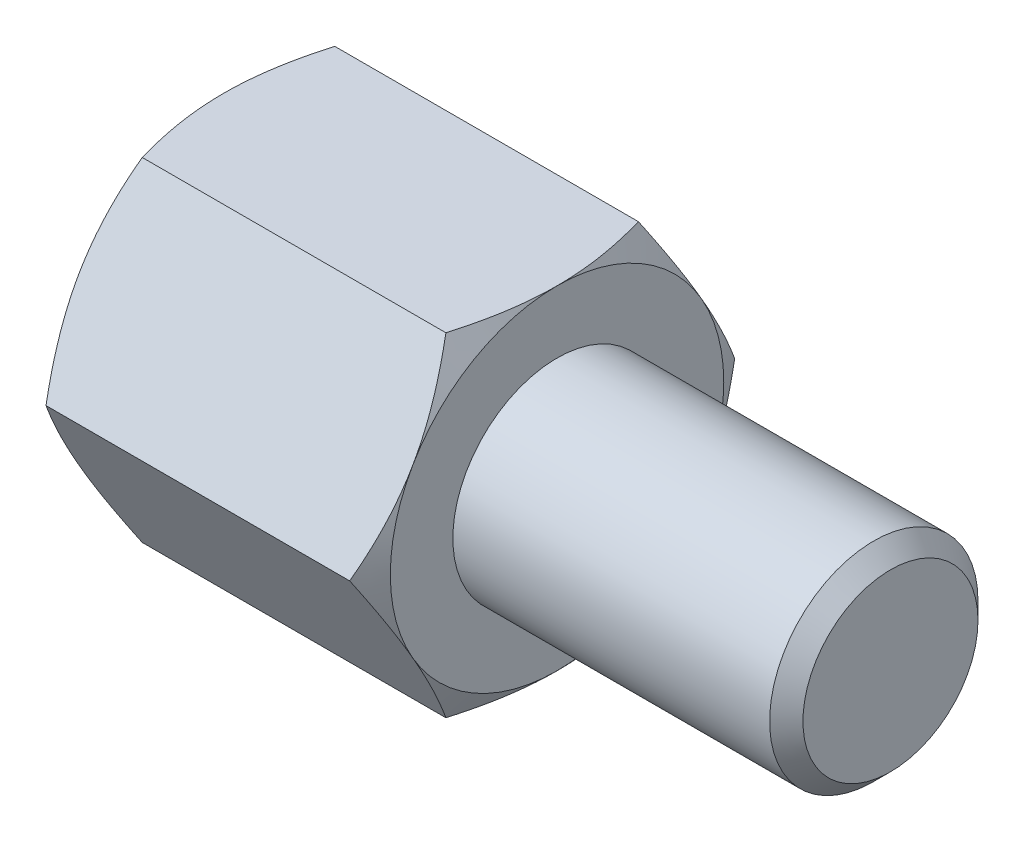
ISO-10303-21;
HEADER;
FILE_DESCRIPTION(('STEP AP214'),'2;1');
FILE_NAME('part.step','',(''),(''),'','','');
FILE_SCHEMA(('AUTOMOTIVE_DESIGN { 1 0 10303 214 1 1 1 1 }'));
ENDSEC;
DATA;
#1=APPLICATION_CONTEXT('core data for automotive mechanical design processes');
#2=APPLICATION_PROTOCOL_DEFINITION('international standard','automotive_design',2000,#1);
#3=PRODUCT_CONTEXT('',#1,'mechanical');
#4=PRODUCT('Part','Part','',(#3));
#5=PRODUCT_RELATED_PRODUCT_CATEGORY('part','',(#4));
#6=PRODUCT_DEFINITION_FORMATION('','',#4);
#7=PRODUCT_DEFINITION_CONTEXT('part definition',#1,'design');
#8=PRODUCT_DEFINITION('design','',#6,#7);
#9=PRODUCT_DEFINITION_SHAPE('','',#8);
#10=(LENGTH_UNIT() NAMED_UNIT(*) SI_UNIT(.MILLI.,.METRE.));
#11=(NAMED_UNIT(*) PLANE_ANGLE_UNIT() SI_UNIT($,.RADIAN.));
#12=(NAMED_UNIT(*) SI_UNIT($,.STERADIAN.) SOLID_ANGLE_UNIT());
#13=UNCERTAINTY_MEASURE_WITH_UNIT(LENGTH_MEASURE(1.E-05),#10,'distance_accuracy_value','');
#14=(GEOMETRIC_REPRESENTATION_CONTEXT(3) GLOBAL_UNCERTAINTY_ASSIGNED_CONTEXT((#13)) GLOBAL_UNIT_ASSIGNED_CONTEXT((#10,
#11,#12)) REPRESENTATION_CONTEXT('',''));
#15=CARTESIAN_POINT('',(0.,0.,0.));
#16=DIRECTION('',(0.,0.,1.));
#17=DIRECTION('',(1.,0.,0.));
#18=AXIS2_PLACEMENT_3D('',#15,#16,#17);
#19=CARTESIAN_POINT('',(4.,4.,-2.3094010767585));
#20=DIRECTION('',(1.,0.,0.));
#21=DIRECTION('',(0.,0.,-1.));
#22=AXIS2_PLACEMENT_3D('',#19,#20,#21);
#23=PLANE('',#22);
#24=CARTESIAN_POINT('',(4.,0.,0.));
#25=DIRECTION('',(1.,0.,0.));
#26=DIRECTION('',(0.,0.,-1.));
#27=AXIS2_PLACEMENT_3D('',#24,#25,#26);
#28=CIRCLE('',#27,4.);
#29=CARTESIAN_POINT('',(4.,-2.,-3.46410161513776));
#30=VERTEX_POINT('',#29);
#31=CARTESIAN_POINT('',(4.,2.,-3.46410161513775));
#32=VERTEX_POINT('',#31);
#33=EDGE_CURVE('E288',#30,#32,#28,.T.);
#34=ORIENTED_EDGE('',*,*,#33,.T.);
#35=CARTESIAN_POINT('',(4.,4.,0.));
#36=VERTEX_POINT('',#35);
#37=EDGE_CURVE('E53',#32,#36,#28,.T.);
#38=ORIENTED_EDGE('',*,*,#37,.T.);
#39=CARTESIAN_POINT('',(4.,2.,3.46410161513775));
#40=VERTEX_POINT('',#39);
#41=EDGE_CURVE('E296',#36,#40,#28,.T.);
#42=ORIENTED_EDGE('',*,*,#41,.T.);
#43=CARTESIAN_POINT('',(4.,-2.,3.46410161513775));
#44=VERTEX_POINT('',#43);
#45=EDGE_CURVE('E300',#40,#44,#28,.T.);
#46=ORIENTED_EDGE('',*,*,#45,.T.);
#47=CARTESIAN_POINT('',(4.,0.,0.));
#48=DIRECTION('',(-1.,0.,0.));
#49=DIRECTION('',(0.,-1.,0.));
#50=AXIS2_PLACEMENT_3D('',#47,#48,#49);
#51=CIRCLE('',#50,4.);
#52=CARTESIAN_POINT('',(4.,-4.,0.));
#53=VERTEX_POINT('',#52);
#54=EDGE_CURVE('E193',#53,#44,#51,.T.);
#55=ORIENTED_EDGE('',*,*,#54,.F.);
#56=EDGE_CURVE('E61',#53,#30,#28,.T.);
#57=ORIENTED_EDGE('',*,*,#56,.T.);
#58=EDGE_LOOP('',(#34,#38,#42,#46,#55,#57));
#59=FACE_BOUND('',#58,.T.);
#60=CARTESIAN_POINT('',(4.,0.,0.));
#61=DIRECTION('',(1.,0.,0.));
#62=DIRECTION('',(0.,0.,-1.));
#63=AXIS2_PLACEMENT_3D('',#60,#61,#62);
#64=CIRCLE('',#63,2.5);
#65=CARTESIAN_POINT('',(4.,0.,-2.5));
#66=VERTEX_POINT('',#65);
#67=EDGE_CURVE('E310',#66,#66,#64,.T.);
#68=ORIENTED_EDGE('',*,*,#67,.F.);
#69=EDGE_LOOP('',(#68));
#70=FACE_BOUND('',#69,.T.);
#71=ADVANCED_FACE('F37',(#59,#70),#23,.T.);
#72=CARTESIAN_POINT('',(4.,0.,-4.61880215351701));
#73=DIRECTION('',(0.,-0.5,0.866025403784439));
#74=DIRECTION('',(0.,-0.866025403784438,-0.5));
#75=AXIS2_PLACEMENT_3D('',#72,#73,#74);
#76=PLANE('',#75);
#77=CARTESIAN_POINT('',(3.64266774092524,-0.000200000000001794,-4.61891762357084));
#78=CARTESIAN_POINT('',(3.70128212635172,0.175579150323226,-4.5174314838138));
#79=CARTESIAN_POINT('',(3.75458967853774,0.352875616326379,-4.41506932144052));
#80=CARTESIAN_POINT('',(3.8476383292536,0.710538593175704,-4.2085725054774));
#81=CARTESIAN_POINT('',(3.8873465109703,0.890911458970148,-4.10443418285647));
#82=CARTESIAN_POINT('',(3.94915778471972,1.24942181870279,-3.89744813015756));
#83=CARTESIAN_POINT('',(3.97167226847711,1.42750415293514,-3.79463224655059));
#84=CARTESIAN_POINT('',(3.99854937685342,1.78450671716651,-3.58851671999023));
#85=CARTESIAN_POINT('',(4.00293425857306,1.9634256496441,-3.48521782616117));
#86=CARTESIAN_POINT('',(3.99380992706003,2.29774284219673,-3.29219970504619));
#87=CARTESIAN_POINT('',(3.98254104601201,2.45319115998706,-3.20245157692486));
#88=CARTESIAN_POINT('',(3.94682600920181,2.76307505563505,-3.02354002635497));
#89=CARTESIAN_POINT('',(3.92236765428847,2.91750956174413,-2.93437722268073));
#90=CARTESIAN_POINT('',(3.86122393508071,3.22803232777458,-2.75509682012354));
#91=CARTESIAN_POINT('',(3.82427939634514,3.3840812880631,-2.6650019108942));
#92=CARTESIAN_POINT('',(3.74042992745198,3.69385183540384,-2.486155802));
#93=CARTESIAN_POINT('',(3.69354469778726,3.84757739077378,-2.39740231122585));
#94=CARTESIAN_POINT('',(3.64266774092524,4.0002,-2.30928560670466));
#95=B_SPLINE_CURVE_WITH_KNOTS('',3,(#77,#78,#79,#80,#81,#82,#83,#84,#85,#86,#87,#88,#89,#90,#91,
#92,#93,#94),.UNSPECIFIED.,.F.,.F.,(4,2,2,2,2,2,2,2,4),(0.,0.634047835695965,1.26961969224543,
1.88946157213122,2.50854226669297,3.04757825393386,3.58711366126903,4.13861653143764,
4.68903648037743),.UNSPECIFIED.);
#96=CARTESIAN_POINT('',(3.64273441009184,0.,-4.61880215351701));
#97=VERTEX_POINT('',#96);
#98=EDGE_CURVE('E320',#97,#32,#95,.T.);
#99=ORIENTED_EDGE('',*,*,#98,.F.);
#100=DIRECTION('',(-1.,0.,0.));
#101=VECTOR('',#100,1.);
#102=CARTESIAN_POINT('',(4.,0.,-4.61880215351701));
#103=LINE('',#102,#101);
#104=CARTESIAN_POINT('',(-3.64273441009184,0.,-4.61880215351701));
#105=VERTEX_POINT('',#104);
#106=EDGE_CURVE('E264',#97,#105,#103,.T.);
#107=ORIENTED_EDGE('',*,*,#106,.T.);
#108=CARTESIAN_POINT('',(-3.64266774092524,4.0002,-2.30928560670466));
#109=CARTESIAN_POINT('',(-3.70128212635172,3.82442084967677,-2.4107717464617));
#110=CARTESIAN_POINT('',(-3.75458967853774,3.64712438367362,-2.51313390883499));
#111=CARTESIAN_POINT('',(-3.8476383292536,3.28946140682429,-2.71963072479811));
#112=CARTESIAN_POINT('',(-3.8873465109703,3.10908854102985,-2.82376904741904));
#113=CARTESIAN_POINT('',(-3.94915778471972,2.75057818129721,-3.03075510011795));
#114=CARTESIAN_POINT('',(-3.97167226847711,2.57249584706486,-3.13357098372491));
#115=CARTESIAN_POINT('',(-3.99854937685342,2.21549328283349,-3.33968651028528));
#116=CARTESIAN_POINT('',(-4.00293425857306,2.0365743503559,-3.44298540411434));
#117=CARTESIAN_POINT('',(-3.99380992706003,1.70225715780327,-3.63600352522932));
#118=CARTESIAN_POINT('',(-3.98254104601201,1.54680884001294,-3.72575165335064));
#119=CARTESIAN_POINT('',(-3.94682600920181,1.23692494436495,-3.90466320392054));
#120=CARTESIAN_POINT('',(-3.92236765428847,1.08249043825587,-3.99382600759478));
#121=CARTESIAN_POINT('',(-3.86122393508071,0.771967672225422,-4.17310641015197));
#122=CARTESIAN_POINT('',(-3.82427939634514,0.615918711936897,-4.26320131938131));
#123=CARTESIAN_POINT('',(-3.74042992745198,0.306148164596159,-4.4420474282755));
#124=CARTESIAN_POINT('',(-3.69354469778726,0.152422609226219,-4.53080091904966));
#125=CARTESIAN_POINT('',(-3.64266774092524,-0.000200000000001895,-4.61891762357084));
#126=B_SPLINE_CURVE_WITH_KNOTS('',3,(#108,#109,#110,#111,#112,#113,#114,#115,#116,#117,#118,
#119,#120,#121,#122,#123,#124,#125),.UNSPECIFIED.,.F.,.F.,(4,2,2,2,2,2,2,2,4),(0.,
0.634047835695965,1.26961969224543,1.88946157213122,2.50854226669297,3.04757825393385,
3.58711366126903,4.13861653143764,4.68903648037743),.UNSPECIFIED.);
#127=CARTESIAN_POINT('',(-4.,2.,-3.46410161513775));
#128=VERTEX_POINT('',#127);
#129=EDGE_CURVE('E324',#128,#105,#126,.T.);
#130=ORIENTED_EDGE('',*,*,#129,.F.);
#131=CARTESIAN_POINT('',(-3.64273441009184,4.,-2.3094010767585));
#132=VERTEX_POINT('',#131);
#133=EDGE_CURVE('E321',#132,#128,#126,.T.);
#134=ORIENTED_EDGE('',*,*,#133,.F.);
#135=DIRECTION('',(-1.,0.,0.));
#136=VECTOR('',#135,1.);
#137=CARTESIAN_POINT('',(4.,4.,-2.3094010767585));
#138=LINE('',#137,#136);
#139=CARTESIAN_POINT('',(3.64273441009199,4.,-2.30940107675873));
#140=VERTEX_POINT('',#139);
#141=EDGE_CURVE('E279',#140,#132,#138,.T.);
#142=ORIENTED_EDGE('',*,*,#141,.F.);
#143=EDGE_CURVE('E229',#32,#140,#95,.T.);
#144=ORIENTED_EDGE('',*,*,#143,.F.);
#145=EDGE_LOOP('',(#99,#107,#130,#134,#142,#144));
#146=FACE_BOUND('',#145,.T.);
#147=ADVANCED_FACE('F148',(#146),#76,.F.);
#148=CARTESIAN_POINT('',(4.,4.,-2.3094010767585));
#149=DIRECTION('',(0.,-1.,0.));
#150=DIRECTION('',(0.,0.,-1.));
#151=AXIS2_PLACEMENT_3D('',#148,#149,#150);
#152=PLANE('',#151);
#153=CARTESIAN_POINT('',(2.00829070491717,4.,-6.28479524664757));
#154=CARTESIAN_POINT('',(2.09370060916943,4.,-6.10939349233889));
#155=CARTESIAN_POINT('',(2.17831482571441,4.,-5.93359774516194));
#156=CARTESIAN_POINT('',(2.34550596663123,4.,-5.58100905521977));
#157=CARTESIAN_POINT('',(2.42808258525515,4.,-5.40421596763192));
#158=CARTESIAN_POINT('',(2.59115082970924,4.,-5.04855089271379));
#159=CARTESIAN_POINT('',(2.67162934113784,4.,-4.86967287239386));
#160=CARTESIAN_POINT('',(2.82940015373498,4.,-4.51052237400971));
#161=CARTESIAN_POINT('',(2.90669260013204,4.,-4.33024995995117));
#162=CARTESIAN_POINT('',(3.05980205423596,4.,-3.96189114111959));
#163=CARTESIAN_POINT('',(3.135480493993,4.,-3.77374683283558));
#164=CARTESIAN_POINT('',(3.28130452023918,4.,-3.39528725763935));
#165=CARTESIAN_POINT('',(3.35144949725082,4.,-3.2049717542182));
#166=CARTESIAN_POINT('',(3.4844245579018,4.,-2.82219775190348));
#167=CARTESIAN_POINT('',(3.5472687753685,4.,-2.62974421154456));
#168=CARTESIAN_POINT('',(3.66367969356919,4.,-2.24207725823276));
#169=CARTESIAN_POINT('',(3.71724923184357,4.,-2.04686470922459));
#170=CARTESIAN_POINT('',(3.81230316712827,4.,-1.65467425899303));
#171=CARTESIAN_POINT('',(3.85385633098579,4.,-1.45771333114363));
#172=CARTESIAN_POINT('',(3.92259036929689,4.,-1.06125849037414));
#173=CARTESIAN_POINT('',(3.94977273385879,4.,-0.861764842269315));
#174=CARTESIAN_POINT('',(3.98724473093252,4.,-0.463879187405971));
#175=CARTESIAN_POINT('',(3.99775780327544,4.,-0.265508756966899));
#176=CARTESIAN_POINT('',(4.00159342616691,4.,0.131417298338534));
#177=CARTESIAN_POINT('',(3.99491584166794,4.,0.329972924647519));
#178=CARTESIAN_POINT('',(3.96964892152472,4.,0.664692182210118));
#179=CARTESIAN_POINT('',(3.95537089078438,4.,0.801202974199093));
#180=CARTESIAN_POINT('',(3.9195349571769,4.,1.07327201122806));
#181=CARTESIAN_POINT('',(3.89797613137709,4.,1.20883013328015));
#182=CARTESIAN_POINT('',(3.82350663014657,4.,1.61386939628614));
#183=CARTESIAN_POINT('',(3.76081499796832,4.,1.8815748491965));
#184=CARTESIAN_POINT('',(3.65151174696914,4.,2.28197262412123));
#185=CARTESIAN_POINT('',(3.61200931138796,4.,2.41672443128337));
#186=CARTESIAN_POINT('',(3.52875235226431,4.,2.6849206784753));
#187=CARTESIAN_POINT('',(3.48499779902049,4.,2.81836510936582));
#188=CARTESIAN_POINT('',(3.3939510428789,4.,3.08398596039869));
#189=CARTESIAN_POINT('',(3.34665989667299,4.,3.21616274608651));
#190=CARTESIAN_POINT('',(3.24911111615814,4.,3.47941134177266));
#191=CARTESIAN_POINT('',(3.1988535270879,4.,3.61048316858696));
#192=CARTESIAN_POINT('',(3.07132952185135,4.,3.93385125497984));
#193=CARTESIAN_POINT('',(2.9926014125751,4.,4.1255702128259));
#194=CARTESIAN_POINT('',(2.83096938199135,4.,4.5072455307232));
#195=CARTESIAN_POINT('',(2.74806513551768,4.,4.69720175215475));
#196=CARTESIAN_POINT('',(2.5789699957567,4.,5.0756995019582));
#197=CARTESIAN_POINT('',(2.49277827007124,4.,5.264240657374));
#198=CARTESIAN_POINT('',(2.3178011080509,4.,5.64011758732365));
#199=CARTESIAN_POINT('',(2.22901560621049,4.,5.82745333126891));
#200=CARTESIAN_POINT('',(1.95934323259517,4.,6.3884442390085));
#201=CARTESIAN_POINT('',(1.77535618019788,4.,6.76060781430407));
#202=CARTESIAN_POINT('',(1.4019562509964,4.,7.50211228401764));
#203=CARTESIAN_POINT('',(1.2125442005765,4.,7.87145359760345));
#204=CARTESIAN_POINT('',(0.847387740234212,4.,8.57450173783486));
#205=CARTESIAN_POINT('',(0.671975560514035,4.,8.90838144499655));
#206=CARTESIAN_POINT('',(0.318809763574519,4.,9.57491712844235));
#207=CARTESIAN_POINT('',(0.141056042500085,4.,9.9075730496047));
#208=CARTESIAN_POINT('',(-0.215706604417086,4.,10.5709822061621));
#209=CARTESIAN_POINT('',(-0.394710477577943,3.99999999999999,10.9017381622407));
#210=CARTESIAN_POINT('',(-0.754092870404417,3.99999999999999,11.5624752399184));
#211=CARTESIAN_POINT('',(-0.934471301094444,3.99999999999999,11.8924564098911));
#212=CARTESIAN_POINT('',(-1.11535751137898,3.99999999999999,12.2221569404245));
#213=B_SPLINE_CURVE_WITH_KNOTS('',3,(#153,#154,#155,#156,#157,#158,#159,#160,#161,#162,#163,
#164,#165,#166,#167,#168,#169,#170,#171,#172,#173,#174,#175,#176,#177,#178,#179,#180,#181,#182,
#183,#184,#185,#186,#187,#188,#189,#190,#191,#192,#193,#194,#195,#196,#197,#198,#199,#200,#201,
#202,#203,#204,#205,#206,#207,#208,#209,#210,#211,#212),.UNSPECIFIED.,.F.,.F.,(4,2,2,2,2,2,2,2,
2,2,2,2,2,2,2,2,2,2,2,2,2,2,2,2,2,2,2,2,2,4),(0.,0.585280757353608,1.17064881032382,
1.75906864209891,2.34746162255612,2.95577704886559,3.56415938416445,4.17134357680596,
4.7783416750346,5.38179402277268,5.98518378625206,6.58041501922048,7.17565092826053,
7.58721910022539,7.99883946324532,8.82250155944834,9.24373134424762,9.66496407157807,
10.086071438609,10.5071723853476,11.1288656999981,11.7506074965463,12.3725077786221,
12.9944237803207,14.2398211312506,15.4850297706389,16.6164791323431,17.7479788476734,
18.8762380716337,20.0044248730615),.UNSPECIFIED.);
#214=EDGE_CURVE('E227',#140,#36,#213,.T.);
#215=ORIENTED_EDGE('',*,*,#214,.F.);
#216=ORIENTED_EDGE('',*,*,#141,.T.);
#217=CARTESIAN_POINT('',(-2.00829070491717,4.,-6.28479524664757));
#218=CARTESIAN_POINT('',(-2.09370060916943,4.,-6.10939349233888));
#219=CARTESIAN_POINT('',(-2.17831482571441,4.,-5.93359774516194));
#220=CARTESIAN_POINT('',(-2.34550596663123,4.,-5.58100905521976));
#221=CARTESIAN_POINT('',(-2.42808258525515,4.,-5.40421596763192));
#222=CARTESIAN_POINT('',(-2.59115082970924,4.,-5.04855089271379));
#223=CARTESIAN_POINT('',(-2.67162934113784,4.,-4.86967287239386));
#224=CARTESIAN_POINT('',(-2.82940015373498,4.,-4.51052237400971));
#225=CARTESIAN_POINT('',(-2.90669260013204,4.,-4.33024995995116));
#226=CARTESIAN_POINT('',(-3.05980205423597,4.,-3.96189114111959));
#227=CARTESIAN_POINT('',(-3.135480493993,4.,-3.77374683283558));
#228=CARTESIAN_POINT('',(-3.28130452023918,4.,-3.39528725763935));
#229=CARTESIAN_POINT('',(-3.35144949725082,4.,-3.2049717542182));
#230=CARTESIAN_POINT('',(-3.4844245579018,4.,-2.82219775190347));
#231=CARTESIAN_POINT('',(-3.5472687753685,4.,-2.62974421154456));
#232=CARTESIAN_POINT('',(-3.66367969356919,4.,-2.24207725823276));
#233=CARTESIAN_POINT('',(-3.71724923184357,4.,-2.04686470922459));
#234=CARTESIAN_POINT('',(-3.81230316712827,4.,-1.65467425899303));
#235=CARTESIAN_POINT('',(-3.85385633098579,4.,-1.45771333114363));
#236=CARTESIAN_POINT('',(-3.92259036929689,4.,-1.06125849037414));
#237=CARTESIAN_POINT('',(-3.94977273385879,4.,-0.861764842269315));
#238=CARTESIAN_POINT('',(-3.98724473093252,4.,-0.463879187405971));
#239=CARTESIAN_POINT('',(-3.99775780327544,4.,-0.265508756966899));
#240=CARTESIAN_POINT('',(-4.00159342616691,4.,0.131417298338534));
#241=CARTESIAN_POINT('',(-3.99491584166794,4.,0.329972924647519));
#242=CARTESIAN_POINT('',(-3.96964892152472,4.,0.664692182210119));
#243=CARTESIAN_POINT('',(-3.95537089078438,4.,0.801202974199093));
#244=CARTESIAN_POINT('',(-3.9195349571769,4.,1.07327201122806));
#245=CARTESIAN_POINT('',(-3.89797613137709,4.,1.20883013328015));
#246=CARTESIAN_POINT('',(-3.82350663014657,4.,1.61386939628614));
#247=CARTESIAN_POINT('',(-3.76081499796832,4.,1.8815748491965));
#248=CARTESIAN_POINT('',(-3.65151174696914,4.,2.28197262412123));
#249=CARTESIAN_POINT('',(-3.61200931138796,4.,2.41672443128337));
#250=CARTESIAN_POINT('',(-3.52875235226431,4.,2.68492067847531));
#251=CARTESIAN_POINT('',(-3.48499779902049,4.,2.81836510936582));
#252=CARTESIAN_POINT('',(-3.3939510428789,4.,3.08398596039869));
#253=CARTESIAN_POINT('',(-3.34665989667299,4.,3.21616274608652));
#254=CARTESIAN_POINT('',(-3.24911111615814,4.,3.47941134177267));
#255=CARTESIAN_POINT('',(-3.1988535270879,4.,3.61048316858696));
#256=CARTESIAN_POINT('',(-3.07132952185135,4.,3.93385125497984));
#257=CARTESIAN_POINT('',(-2.9926014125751,4.,4.1255702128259));
#258=CARTESIAN_POINT('',(-2.83096938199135,4.,4.5072455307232));
#259=CARTESIAN_POINT('',(-2.74806513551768,4.,4.69720175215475));
#260=CARTESIAN_POINT('',(-2.5789699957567,4.,5.0756995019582));
#261=CARTESIAN_POINT('',(-2.49277827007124,4.,5.264240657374));
#262=CARTESIAN_POINT('',(-2.3178011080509,4.,5.64011758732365));
#263=CARTESIAN_POINT('',(-2.22901560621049,4.,5.82745333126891));
#264=CARTESIAN_POINT('',(-1.95934323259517,4.,6.3884442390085));
#265=CARTESIAN_POINT('',(-1.77535618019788,4.,6.76060781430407));
#266=CARTESIAN_POINT('',(-1.4019562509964,4.,7.50211228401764));
#267=CARTESIAN_POINT('',(-1.2125442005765,4.,7.87145359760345));
#268=CARTESIAN_POINT('',(-0.847387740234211,4.,8.57450173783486));
#269=CARTESIAN_POINT('',(-0.671975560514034,4.,8.90838144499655));
#270=CARTESIAN_POINT('',(-0.318809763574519,4.,9.57491712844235));
#271=CARTESIAN_POINT('',(-0.141056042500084,4.,9.9075730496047));
#272=CARTESIAN_POINT('',(0.215706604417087,4.,10.5709822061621));
#273=CARTESIAN_POINT('',(0.394710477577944,3.99999999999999,10.9017381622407));
#274=CARTESIAN_POINT('',(0.754092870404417,3.99999999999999,11.5624752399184));
#275=CARTESIAN_POINT('',(0.934471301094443,3.99999999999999,11.8924564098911));
#276=CARTESIAN_POINT('',(1.11535751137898,3.99999999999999,12.2221569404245));
#277=B_SPLINE_CURVE_WITH_KNOTS('',3,(#217,#218,#219,#220,#221,#222,#223,#224,#225,#226,#227,
#228,#229,#230,#231,#232,#233,#234,#235,#236,#237,#238,#239,#240,#241,#242,#243,#244,#245,#246,
#247,#248,#249,#250,#251,#252,#253,#254,#255,#256,#257,#258,#259,#260,#261,#262,#263,#264,#265,
#266,#267,#268,#269,#270,#271,#272,#273,#274,#275,#276),.UNSPECIFIED.,.F.,.F.,(4,2,2,2,2,2,2,2,
2,2,2,2,2,2,2,2,2,2,2,2,2,2,2,2,2,2,2,2,2,4),(0.,0.585280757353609,1.17064881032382,
1.75906864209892,2.34746162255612,2.95577704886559,3.56415938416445,4.17134357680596,
4.7783416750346,5.38179402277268,5.98518378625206,6.58041501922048,7.17565092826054,
7.58721910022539,7.99883946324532,8.82250155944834,9.24373134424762,9.66496407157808,
10.086071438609,10.5071723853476,11.1288656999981,11.7506074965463,12.3725077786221,
12.9944237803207,14.2398211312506,15.4850297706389,16.6164791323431,17.7479788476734,
18.8762380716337,20.0044248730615),.UNSPECIFIED.);
#278=CARTESIAN_POINT('',(-4.,4.,0.));
#279=VERTEX_POINT('',#278);
#280=EDGE_CURVE('E241',#279,#132,#277,.F.);
#281=ORIENTED_EDGE('',*,*,#280,.F.);
#282=CARTESIAN_POINT('',(-3.64273441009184,4.,2.3094010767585));
#283=VERTEX_POINT('',#282);
#284=EDGE_CURVE('E249',#283,#279,#277,.F.);
#285=ORIENTED_EDGE('',*,*,#284,.F.);
#286=DIRECTION('',(-1.,0.,0.));
#287=VECTOR('',#286,1.);
#288=CARTESIAN_POINT('',(4.,4.,2.3094010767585));
#289=LINE('',#288,#287);
#290=CARTESIAN_POINT('',(3.64273441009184,4.,2.3094010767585));
#291=VERTEX_POINT('',#290);
#292=EDGE_CURVE('E276',#291,#283,#289,.T.);
#293=ORIENTED_EDGE('',*,*,#292,.F.);
#294=EDGE_CURVE('E221',#36,#291,#213,.T.);
#295=ORIENTED_EDGE('',*,*,#294,.F.);
#296=EDGE_LOOP('',(#215,#216,#281,#285,#293,#295));
#297=FACE_BOUND('',#296,.T.);
#298=ADVANCED_FACE('F153',(#297),#152,.F.);
#299=CARTESIAN_POINT('',(4.,4.,2.3094010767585));
#300=DIRECTION('',(0.,-0.5,-0.866025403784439));
#301=DIRECTION('',(0.,0.866025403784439,-0.5));
#302=AXIS2_PLACEMENT_3D('',#299,#300,#301);
#303=PLANE('',#302);
#304=CARTESIAN_POINT('',(3.64266774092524,4.0002,2.30928560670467));
#305=CARTESIAN_POINT('',(3.70128212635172,3.82442084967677,2.4107717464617));
#306=CARTESIAN_POINT('',(3.75458967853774,3.64712438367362,2.51313390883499));
#307=CARTESIAN_POINT('',(3.8476383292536,3.28946140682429,2.71963072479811));
#308=CARTESIAN_POINT('',(3.8873465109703,3.10908854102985,2.82376904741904));
#309=CARTESIAN_POINT('',(3.94915778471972,2.75057818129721,3.03075510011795));
#310=CARTESIAN_POINT('',(3.97167226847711,2.57249584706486,3.13357098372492));
#311=CARTESIAN_POINT('',(3.99854937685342,2.21549328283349,3.33968651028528));
#312=CARTESIAN_POINT('',(4.00293425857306,2.0365743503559,3.44298540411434));
#313=CARTESIAN_POINT('',(3.99380992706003,1.70225715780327,3.63600352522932));
#314=CARTESIAN_POINT('',(3.98254104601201,1.54680884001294,3.72575165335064));
#315=CARTESIAN_POINT('',(3.94682600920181,1.23692494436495,3.90466320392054));
#316=CARTESIAN_POINT('',(3.92236765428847,1.08249043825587,3.99382600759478));
#317=CARTESIAN_POINT('',(3.86122393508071,0.771967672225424,4.17310641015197));
#318=CARTESIAN_POINT('',(3.82427939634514,0.615918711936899,4.26320131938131));
#319=CARTESIAN_POINT('',(3.74042992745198,0.306148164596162,4.4420474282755));
#320=CARTESIAN_POINT('',(3.69354469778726,0.152422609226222,4.53080091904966));
#321=CARTESIAN_POINT('',(3.64266774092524,-0.000199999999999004,4.61891762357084));
#322=B_SPLINE_CURVE_WITH_KNOTS('',3,(#304,#305,#306,#307,#308,#309,#310,#311,#312,#313,#314,
#315,#316,#317,#318,#319,#320,#321),.UNSPECIFIED.,.F.,.F.,(4,2,2,2,2,2,2,2,4),(0.,
0.634047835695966,1.26961969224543,1.88946157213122,2.50854226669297,3.04757825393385,
3.58711366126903,4.13861653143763,4.68903648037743),.UNSPECIFIED.);
#323=EDGE_CURVE('E228',#291,#40,#322,.T.);
#324=ORIENTED_EDGE('',*,*,#323,.F.);
#325=ORIENTED_EDGE('',*,*,#292,.T.);
#326=CARTESIAN_POINT('',(-3.64266774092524,-0.000199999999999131,4.61891762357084));
#327=CARTESIAN_POINT('',(-3.70128212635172,0.175579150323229,4.5174314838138));
#328=CARTESIAN_POINT('',(-3.75458967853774,0.352875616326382,4.41506932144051));
#329=CARTESIAN_POINT('',(-3.8476383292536,0.710538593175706,4.20857250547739));
#330=CARTESIAN_POINT('',(-3.8873465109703,0.89091145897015,4.10443418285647));
#331=CARTESIAN_POINT('',(-3.94915778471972,1.24942181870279,3.89744813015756));
#332=CARTESIAN_POINT('',(-3.97167226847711,1.42750415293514,3.79463224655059));
#333=CARTESIAN_POINT('',(-3.99854937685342,1.78450671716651,3.58851671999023));
#334=CARTESIAN_POINT('',(-4.00293425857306,1.9634256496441,3.48521782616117));
#335=CARTESIAN_POINT('',(-3.99380992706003,2.29774284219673,3.29219970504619));
#336=CARTESIAN_POINT('',(-3.98254104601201,2.45319115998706,3.20245157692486));
#337=CARTESIAN_POINT('',(-3.94682600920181,2.76307505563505,3.02354002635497));
#338=CARTESIAN_POINT('',(-3.92236765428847,2.91750956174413,2.93437722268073));
#339=CARTESIAN_POINT('',(-3.86122393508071,3.22803232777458,2.75509682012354));
#340=CARTESIAN_POINT('',(-3.82427939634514,3.3840812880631,2.6650019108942));
#341=CARTESIAN_POINT('',(-3.74042992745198,3.69385183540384,2.48615580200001));
#342=CARTESIAN_POINT('',(-3.69354469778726,3.84757739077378,2.39740231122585));
#343=CARTESIAN_POINT('',(-3.64266774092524,4.0002,2.30928560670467));
#344=B_SPLINE_CURVE_WITH_KNOTS('',3,(#326,#327,#328,#329,#330,#331,#332,#333,#334,#335,#336,
#337,#338,#339,#340,#341,#342,#343),.UNSPECIFIED.,.F.,.F.,(4,2,2,2,2,2,2,2,4),(0.,
0.634047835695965,1.26961969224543,1.88946157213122,2.50854226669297,3.04757825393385,
3.58711366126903,4.13861653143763,4.68903648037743),.UNSPECIFIED.);
#345=CARTESIAN_POINT('',(-4.,2.,3.46410161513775));
#346=VERTEX_POINT('',#345);
#347=EDGE_CURVE('E255',#346,#283,#344,.T.);
#348=ORIENTED_EDGE('',*,*,#347,.F.);
#349=CARTESIAN_POINT('',(-3.64273441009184,0.,4.618802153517));
#350=VERTEX_POINT('',#349);
#351=EDGE_CURVE('E262',#350,#346,#344,.T.);
#352=ORIENTED_EDGE('',*,*,#351,.F.);
#353=DIRECTION('',(-1.,0.,0.));
#354=VECTOR('',#353,1.);
#355=CARTESIAN_POINT('',(4.,0.,4.618802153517));
#356=LINE('',#355,#354);
#357=CARTESIAN_POINT('',(3.64273441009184,0.,4.618802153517));
#358=VERTEX_POINT('',#357);
#359=EDGE_CURVE('E273',#358,#350,#356,.T.);
#360=ORIENTED_EDGE('',*,*,#359,.F.);
#361=EDGE_CURVE('E215',#40,#358,#322,.T.);
#362=ORIENTED_EDGE('',*,*,#361,.F.);
#363=EDGE_LOOP('',(#324,#325,#348,#352,#360,#362));
#364=FACE_BOUND('',#363,.T.);
#365=ADVANCED_FACE('F235',(#364),#303,.F.);
#366=CARTESIAN_POINT('',(4.,0.,4.618802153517));
#367=DIRECTION('',(0.,0.5,-0.866025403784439));
#368=DIRECTION('',(0.,0.866025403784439,0.5));
#369=AXIS2_PLACEMENT_3D('',#366,#367,#368);
#370=PLANE('',#369);
#371=CARTESIAN_POINT('',(3.64266774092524,0.000200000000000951,4.61891762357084));
#372=CARTESIAN_POINT('',(3.70128212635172,-0.175579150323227,4.5174314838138));
#373=CARTESIAN_POINT('',(3.75458967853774,-0.35287561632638,4.41506932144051));
#374=CARTESIAN_POINT('',(3.8476383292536,-0.710538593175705,4.20857250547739));
#375=CARTESIAN_POINT('',(3.8873465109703,-0.890911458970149,4.10443418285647));
#376=CARTESIAN_POINT('',(3.94915778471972,-1.24942181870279,3.89744813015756));
#377=CARTESIAN_POINT('',(3.97167226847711,-1.42750415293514,3.79463224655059));
#378=CARTESIAN_POINT('',(3.99854937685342,-1.78450671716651,3.58851671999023));
#379=CARTESIAN_POINT('',(4.00293425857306,-1.9634256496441,3.48521782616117));
#380=CARTESIAN_POINT('',(3.99380992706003,-2.29774284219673,3.29219970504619));
#381=CARTESIAN_POINT('',(3.98254104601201,-2.45319115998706,3.20245157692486));
#382=CARTESIAN_POINT('',(3.94682600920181,-2.76307505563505,3.02354002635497));
#383=CARTESIAN_POINT('',(3.92236765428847,-2.91750956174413,2.93437722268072));
#384=CARTESIAN_POINT('',(3.86122393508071,-3.22803232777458,2.75509682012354));
#385=CARTESIAN_POINT('',(3.82427939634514,-3.3840812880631,2.6650019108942));
#386=CARTESIAN_POINT('',(3.74042992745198,-3.69385183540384,2.48615580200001));
#387=CARTESIAN_POINT('',(3.69354469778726,-3.84757739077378,2.39740231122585));
#388=CARTESIAN_POINT('',(3.64266774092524,-4.0002,2.30928560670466));
#389=B_SPLINE_CURVE_WITH_KNOTS('',3,(#371,#372,#373,#374,#375,#376,#377,#378,#379,#380,#381,
#382,#383,#384,#385,#386,#387,#388),.UNSPECIFIED.,.F.,.F.,(4,2,2,2,2,2,2,2,4),(0.,
0.634047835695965,1.26961969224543,1.88946157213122,2.50854226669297,3.04757825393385,
3.58711366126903,4.13861653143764,4.68903648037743),.UNSPECIFIED.);
#390=EDGE_CURVE('E517',#358,#44,#389,.T.);
#391=ORIENTED_EDGE('',*,*,#390,.F.);
#392=ORIENTED_EDGE('',*,*,#359,.T.);
#393=CARTESIAN_POINT('',(-3.64266774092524,-4.0002,2.30928560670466));
#394=CARTESIAN_POINT('',(-3.70128212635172,-3.82442084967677,2.4107717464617));
#395=CARTESIAN_POINT('',(-3.75458967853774,-3.64712438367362,2.51313390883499));
#396=CARTESIAN_POINT('',(-3.8476383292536,-3.28946140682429,2.71963072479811));
#397=CARTESIAN_POINT('',(-3.8873465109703,-3.10908854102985,2.82376904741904));
#398=CARTESIAN_POINT('',(-3.94915778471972,-2.75057818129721,3.03075510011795));
#399=CARTESIAN_POINT('',(-3.97167226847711,-2.57249584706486,3.13357098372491));
#400=CARTESIAN_POINT('',(-3.99854937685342,-2.21549328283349,3.33968651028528));
#401=CARTESIAN_POINT('',(-4.00293425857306,-2.0365743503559,3.44298540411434));
#402=CARTESIAN_POINT('',(-3.99380992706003,-1.70225715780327,3.63600352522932));
#403=CARTESIAN_POINT('',(-3.98254104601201,-1.54680884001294,3.72575165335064));
#404=CARTESIAN_POINT('',(-3.94682600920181,-1.23692494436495,3.90466320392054));
#405=CARTESIAN_POINT('',(-3.92236765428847,-1.08249043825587,3.99382600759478));
#406=CARTESIAN_POINT('',(-3.86122393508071,-0.771967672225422,4.17310641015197));
#407=CARTESIAN_POINT('',(-3.82427939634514,-0.615918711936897,4.26320131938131));
#408=CARTESIAN_POINT('',(-3.74042992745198,-0.30614816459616,4.4420474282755));
#409=CARTESIAN_POINT('',(-3.69354469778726,-0.15242260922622,4.53080091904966));
#410=CARTESIAN_POINT('',(-3.64266774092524,0.000200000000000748,4.61891762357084));
#411=B_SPLINE_CURVE_WITH_KNOTS('',3,(#393,#394,#395,#396,#397,#398,#399,#400,#401,#402,#403,
#404,#405,#406,#407,#408,#409,#410),.UNSPECIFIED.,.F.,.F.,(4,2,2,2,2,2,2,2,4),(0.,
0.634047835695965,1.26961969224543,1.88946157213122,2.50854226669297,3.04757825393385,
3.58711366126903,4.13861653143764,4.68903648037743),.UNSPECIFIED.);
#412=CARTESIAN_POINT('',(-4.,-2.,3.46410161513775));
#413=VERTEX_POINT('',#412);
#414=EDGE_CURVE('E263',#413,#350,#411,.T.);
#415=ORIENTED_EDGE('',*,*,#414,.F.);
#416=CARTESIAN_POINT('',(-3.64273441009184,-4.,2.3094010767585));
#417=VERTEX_POINT('',#416);
#418=EDGE_CURVE('E250',#417,#413,#411,.T.);
#419=ORIENTED_EDGE('',*,*,#418,.F.);
#420=DIRECTION('',(-1.,0.,0.));
#421=VECTOR('',#420,1.);
#422=CARTESIAN_POINT('',(4.,-4.,2.3094010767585));
#423=LINE('',#422,#421);
#424=CARTESIAN_POINT('',(3.64273441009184,-4.,2.3094010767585));
#425=VERTEX_POINT('',#424);
#426=EDGE_CURVE('E270',#425,#417,#423,.T.);
#427=ORIENTED_EDGE('',*,*,#426,.F.);
#428=EDGE_CURVE('E210',#44,#425,#389,.T.);
#429=ORIENTED_EDGE('',*,*,#428,.F.);
#430=EDGE_LOOP('',(#391,#392,#415,#419,#427,#429));
#431=FACE_BOUND('',#430,.T.);
#432=ADVANCED_FACE('F432',(#431),#370,.F.);
#433=CARTESIAN_POINT('',(4.,-4.,2.3094010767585));
#434=DIRECTION('',(0.,1.,0.));
#435=DIRECTION('',(0.,0.,1.));
#436=AXIS2_PLACEMENT_3D('',#433,#434,#435);
#437=PLANE('',#436);
#438=CARTESIAN_POINT('',(2.00829070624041,-4.,-6.28479524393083));
#439=CARTESIAN_POINT('',(2.09370061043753,-4.,-6.10939348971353));
#440=CARTESIAN_POINT('',(2.1783148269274,-4.,-5.93359774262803));
#441=CARTESIAN_POINT('',(2.34550596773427,-4.,-5.58100905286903));
#442=CARTESIAN_POINT('',(2.42808258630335,-4.,-5.40421596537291));
#443=CARTESIAN_POINT('',(2.59115083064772,-4.,-5.04855089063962));
#444=CARTESIAN_POINT('',(2.67162934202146,-4.,-4.86967287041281));
#445=CARTESIAN_POINT('',(2.82940015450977,-4.,-4.51052237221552));
#446=CARTESIAN_POINT('',(2.90669260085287,-4.,-4.33024995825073));
#447=CARTESIAN_POINT('',(3.05980205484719,-4.,-3.96189113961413));
#448=CARTESIAN_POINT('',(3.13548049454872,-4.,-3.77374683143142));
#449=CARTESIAN_POINT('',(3.28130452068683,-4.,-3.39528725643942));
#450=CARTESIAN_POINT('',(3.35144949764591,-4.,-3.2049717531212));
#451=CARTESIAN_POINT('',(3.48442455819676,-4.,-2.82219775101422));
#452=CARTESIAN_POINT('',(3.54726877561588,-4.,-2.62974421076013));
#453=CARTESIAN_POINT('',(3.66367969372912,-4.,-2.24207725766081));
#454=CARTESIAN_POINT('',(3.71724923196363,-4.,-2.04686470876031));
#455=CARTESIAN_POINT('',(3.81230316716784,-4.,-1.65467425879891));
#456=CARTESIAN_POINT('',(3.85385633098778,-4.,-1.45771333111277));
#457=CARTESIAN_POINT('',(3.9225903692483,-4.,-1.06125849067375));
#458=CARTESIAN_POINT('',(3.94977273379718,-4.,-0.861764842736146));
#459=CARTESIAN_POINT('',(3.9872447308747,-4.,-0.463879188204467));
#460=CARTESIAN_POINT('',(3.99775780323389,-4.,-0.265508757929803));
#461=CARTESIAN_POINT('',(4.00159342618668,-4.,0.13141729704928));
#462=CARTESIAN_POINT('',(3.99491584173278,-4.,0.329972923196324));
#463=CARTESIAN_POINT('',(3.96964892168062,-4.,0.664692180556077));
#464=CARTESIAN_POINT('',(3.95537089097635,-4.,0.80120297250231));
#465=CARTESIAN_POINT('',(3.9195349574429,-4.,1.07327200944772));
#466=CARTESIAN_POINT('',(3.89797613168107,-4.,1.208830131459));
#467=CARTESIAN_POINT('',(3.82350663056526,-4.,1.6138693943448));
#468=CARTESIAN_POINT('',(3.76081499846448,-4.,1.88157484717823));
#469=CARTESIAN_POINT('',(3.65151174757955,-4.,2.28197262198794));
#470=CARTESIAN_POINT('',(3.6120093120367,-4.,2.41672442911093));
#471=CARTESIAN_POINT('',(3.52875235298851,-4.,2.68492067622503));
#472=CARTESIAN_POINT('',(3.48499779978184,-4.,2.81836510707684));
#473=CARTESIAN_POINT('',(3.39395104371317,-4.,3.0839859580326));
#474=CARTESIAN_POINT('',(3.34665989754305,-4.,3.21616274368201));
#475=CARTESIAN_POINT('',(3.24911111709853,-4.,3.47941133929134));
#476=CARTESIAN_POINT('',(3.19885352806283,-4.,3.61048316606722));
#477=CARTESIAN_POINT('',(3.07132952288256,-4.,3.93385125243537));
#478=CARTESIAN_POINT('',(2.99260141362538,-4.,4.12557021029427));
#479=CARTESIAN_POINT('',(2.83096938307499,-4.,4.50724552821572));
#480=CARTESIAN_POINT('',(2.7480651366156,-4.,4.69720174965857));
#481=CARTESIAN_POINT('',(2.57896999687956,-4.,5.07569949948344));
#482=CARTESIAN_POINT('',(2.49277827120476,-4.,5.26424065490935));
#483=CARTESIAN_POINT('',(2.31780110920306,-4.,5.64011758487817));
#484=CARTESIAN_POINT('',(2.22901560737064,-4.,5.8274533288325));
#485=CARTESIAN_POINT('',(1.95934323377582,-4.,6.38844423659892));
#486=CARTESIAN_POINT('',(1.77535618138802,-4.,6.76060781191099));
#487=CARTESIAN_POINT('',(1.40195625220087,-4.,7.50211228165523));
#488=CARTESIAN_POINT('',(1.2125442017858,-4.,7.8714535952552));
#489=CARTESIAN_POINT('',(0.847387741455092,-4.,8.57450173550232));
#490=CARTESIAN_POINT('',(0.671975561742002,-4.,8.90838144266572));
#491=CARTESIAN_POINT('',(0.318809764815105,-4.,9.57491712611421));
#492=CARTESIAN_POINT('',(0.141056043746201,-4.,9.90757304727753));
#493=CARTESIAN_POINT('',(-0.21570660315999,-4.,10.5709822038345));
#494=CARTESIAN_POINT('',(-0.394710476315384,-4.,10.9017381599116));
#495=CARTESIAN_POINT('',(-0.754092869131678,-4.,11.562475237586));
#496=CARTESIAN_POINT('',(-0.934471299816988,-4.,11.8924564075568));
#497=CARTESIAN_POINT('',(-1.11535751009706,-4.,12.2221569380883));
#498=B_SPLINE_CURVE_WITH_KNOTS('',3,(#438,#439,#440,#441,#442,#443,#444,#445,#446,#447,#448,
#449,#450,#451,#452,#453,#454,#455,#456,#457,#458,#459,#460,#461,#462,#463,#464,#465,#466,#467,
#468,#469,#470,#471,#472,#473,#474,#475,#476,#477,#478,#479,#480,#481,#482,#483,#484,#485,#486,
#487,#488,#489,#490,#491,#492,#493,#494,#495,#496,#497),.UNSPECIFIED.,.F.,.F.,(4,2,2,2,2,2,2,2,
2,2,2,2,2,2,2,2,2,2,2,2,2,2,2,2,2,2,2,2,2,4),(0.,0.585280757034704,1.17064880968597,
1.75906864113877,2.34746162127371,2.95577704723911,3.56415938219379,4.17134357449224,
4.77834167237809,5.38179401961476,5.98518378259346,6.58041501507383,7.1756509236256,
7.5872190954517,7.99883945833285,8.82250155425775,9.24373133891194,9.66496406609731,
10.0860714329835,10.5071723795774,11.1288656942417,11.7506074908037,12.3725077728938,
12.9944237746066,14.2398211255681,15.4850297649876,16.6164791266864,17.7479788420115,
18.8762380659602,20.0044248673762),.UNSPECIFIED.);
#499=EDGE_CURVE('E331',#425,#53,#498,.F.);
#500=ORIENTED_EDGE('',*,*,#499,.F.);
#501=ORIENTED_EDGE('',*,*,#426,.T.);
#502=CARTESIAN_POINT('',(-2.00829070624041,-4.,-6.28479524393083));
#503=CARTESIAN_POINT('',(-2.09370061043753,-4.,-6.10939348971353));
#504=CARTESIAN_POINT('',(-2.1783148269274,-4.,-5.93359774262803));
#505=CARTESIAN_POINT('',(-2.34550596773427,-4.,-5.58100905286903));
#506=CARTESIAN_POINT('',(-2.42808258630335,-4.,-5.40421596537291));
#507=CARTESIAN_POINT('',(-2.59115083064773,-4.,-5.04855089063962));
#508=CARTESIAN_POINT('',(-2.67162934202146,-4.,-4.86967287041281));
#509=CARTESIAN_POINT('',(-2.82940015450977,-4.,-4.51052237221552));
#510=CARTESIAN_POINT('',(-2.90669260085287,-4.,-4.33024995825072));
#511=CARTESIAN_POINT('',(-3.05980205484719,-4.,-3.96189113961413));
#512=CARTESIAN_POINT('',(-3.13548049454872,-4.,-3.77374683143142));
#513=CARTESIAN_POINT('',(-3.28130452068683,-4.,-3.39528725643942));
#514=CARTESIAN_POINT('',(-3.35144949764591,-4.,-3.20497175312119));
#515=CARTESIAN_POINT('',(-3.48442455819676,-4.,-2.82219775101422));
#516=CARTESIAN_POINT('',(-3.54726877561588,-4.,-2.62974421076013));
#517=CARTESIAN_POINT('',(-3.66367969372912,-4.,-2.24207725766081));
#518=CARTESIAN_POINT('',(-3.71724923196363,-4.,-2.04686470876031));
#519=CARTESIAN_POINT('',(-3.81230316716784,-4.,-1.65467425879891));
#520=CARTESIAN_POINT('',(-3.85385633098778,-4.,-1.45771333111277));
#521=CARTESIAN_POINT('',(-3.9225903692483,-4.,-1.06125849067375));
#522=CARTESIAN_POINT('',(-3.94977273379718,-4.,-0.861764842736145));
#523=CARTESIAN_POINT('',(-3.9872447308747,-4.,-0.463879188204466));
#524=CARTESIAN_POINT('',(-3.99775780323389,-4.,-0.265508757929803));
#525=CARTESIAN_POINT('',(-4.00159342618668,-4.,0.131417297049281));
#526=CARTESIAN_POINT('',(-3.99491584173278,-4.,0.329972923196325));
#527=CARTESIAN_POINT('',(-3.96964892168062,-4.,0.664692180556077));
#528=CARTESIAN_POINT('',(-3.95537089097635,-4.,0.80120297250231));
#529=CARTESIAN_POINT('',(-3.9195349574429,-4.,1.07327200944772));
#530=CARTESIAN_POINT('',(-3.89797613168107,-4.,1.208830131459));
#531=CARTESIAN_POINT('',(-3.82350663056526,-4.,1.6138693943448));
#532=CARTESIAN_POINT('',(-3.76081499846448,-4.,1.88157484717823));
#533=CARTESIAN_POINT('',(-3.65151174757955,-4.,2.28197262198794));
#534=CARTESIAN_POINT('',(-3.6120093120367,-4.,2.41672442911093));
#535=CARTESIAN_POINT('',(-3.52875235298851,-4.,2.68492067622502));
#536=CARTESIAN_POINT('',(-3.48499779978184,-4.,2.81836510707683));
#537=CARTESIAN_POINT('',(-3.39395104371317,-4.,3.0839859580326));
#538=CARTESIAN_POINT('',(-3.34665989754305,-4.,3.21616274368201));
#539=CARTESIAN_POINT('',(-3.24911111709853,-4.,3.47941133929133));
#540=CARTESIAN_POINT('',(-3.19885352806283,-4.,3.61048316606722));
#541=CARTESIAN_POINT('',(-3.07132952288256,-4.,3.93385125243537));
#542=CARTESIAN_POINT('',(-2.99260141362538,-4.,4.12557021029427));
#543=CARTESIAN_POINT('',(-2.830969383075,-4.,4.50724552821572));
#544=CARTESIAN_POINT('',(-2.74806513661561,-4.,4.69720174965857));
#545=CARTESIAN_POINT('',(-2.57896999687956,-4.,5.07569949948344));
#546=CARTESIAN_POINT('',(-2.49277827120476,-4.,5.26424065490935));
#547=CARTESIAN_POINT('',(-2.31780110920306,-4.,5.64011758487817));
#548=CARTESIAN_POINT('',(-2.22901560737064,-4.,5.8274533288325));
#549=CARTESIAN_POINT('',(-1.95934323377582,-4.,6.38844423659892));
#550=CARTESIAN_POINT('',(-1.77535618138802,-4.,6.76060781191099));
#551=CARTESIAN_POINT('',(-1.40195625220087,-4.,7.50211228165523));
#552=CARTESIAN_POINT('',(-1.2125442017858,-4.,7.8714535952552));
#553=CARTESIAN_POINT('',(-0.84738774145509,-4.,8.57450173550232));
#554=CARTESIAN_POINT('',(-0.671975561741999,-4.,8.90838144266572));
#555=CARTESIAN_POINT('',(-0.318809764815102,-4.,9.57491712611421));
#556=CARTESIAN_POINT('',(-0.141056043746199,-4.,9.90757304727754));
#557=CARTESIAN_POINT('',(0.215706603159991,-4.,10.5709822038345));
#558=CARTESIAN_POINT('',(0.394710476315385,-4.,10.9017381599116));
#559=CARTESIAN_POINT('',(0.754092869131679,-4.,11.562475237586));
#560=CARTESIAN_POINT('',(0.934471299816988,-4.,11.8924564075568));
#561=CARTESIAN_POINT('',(1.11535751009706,-4.,12.2221569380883));
#562=B_SPLINE_CURVE_WITH_KNOTS('',3,(#502,#503,#504,#505,#506,#507,#508,#509,#510,#511,#512,
#513,#514,#515,#516,#517,#518,#519,#520,#521,#522,#523,#524,#525,#526,#527,#528,#529,#530,#531,
#532,#533,#534,#535,#536,#537,#538,#539,#540,#541,#542,#543,#544,#545,#546,#547,#548,#549,#550,
#551,#552,#553,#554,#555,#556,#557,#558,#559,#560,#561),.UNSPECIFIED.,.F.,.F.,(4,2,2,2,2,2,2,2,
2,2,2,2,2,2,2,2,2,2,2,2,2,2,2,2,2,2,2,2,2,4),(0.,0.585280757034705,1.17064880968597,
1.75906864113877,2.34746162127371,2.95577704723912,3.56415938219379,4.17134357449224,
4.77834167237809,5.38179401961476,5.98518378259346,6.58041501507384,7.1756509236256,
7.5872190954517,7.99883945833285,8.82250155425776,9.24373133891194,9.66496406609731,
10.0860714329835,10.5071723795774,11.1288656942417,11.7506074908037,12.3725077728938,
12.9944237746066,14.2398211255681,15.4850297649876,16.6164791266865,17.7479788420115,
18.8762380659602,20.0044248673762),.UNSPECIFIED.);
#563=CARTESIAN_POINT('',(-4.,-4.,0.));
#564=VERTEX_POINT('',#563);
#565=EDGE_CURVE('E323',#564,#417,#562,.T.);
#566=ORIENTED_EDGE('',*,*,#565,.F.);
#567=CARTESIAN_POINT('',(-3.64273441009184,-4.,-2.3094010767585));
#568=VERTEX_POINT('',#567);
#569=EDGE_CURVE('E327',#568,#564,#562,.T.);
#570=ORIENTED_EDGE('',*,*,#569,.F.);
#571=DIRECTION('',(-1.,0.,0.));
#572=VECTOR('',#571,1.);
#573=CARTESIAN_POINT('',(4.,-4.,-2.3094010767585));
#574=LINE('',#573,#572);
#575=CARTESIAN_POINT('',(3.64273441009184,-4.,-2.3094010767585));
#576=VERTEX_POINT('',#575);
#577=EDGE_CURVE('E267',#576,#568,#574,.T.);
#578=ORIENTED_EDGE('',*,*,#577,.F.);
#579=EDGE_CURVE('E195',#53,#576,#498,.F.);
#580=ORIENTED_EDGE('',*,*,#579,.F.);
#581=EDGE_LOOP('',(#500,#501,#566,#570,#578,#580));
#582=FACE_BOUND('',#581,.T.);
#583=ADVANCED_FACE('F172',(#582),#437,.F.);
#584=CARTESIAN_POINT('',(4.,-4.,-2.3094010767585));
#585=DIRECTION('',(0.,0.5,0.866025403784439));
#586=DIRECTION('',(0.,-0.866025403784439,0.5));
#587=AXIS2_PLACEMENT_3D('',#584,#585,#586);
#588=PLANE('',#587);
#589=CARTESIAN_POINT('',(3.64266774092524,-4.0002,-2.30928560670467));
#590=CARTESIAN_POINT('',(3.70128212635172,-3.82442084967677,-2.4107717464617));
#591=CARTESIAN_POINT('',(3.75458967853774,-3.64712438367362,-2.51313390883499));
#592=CARTESIAN_POINT('',(3.8476383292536,-3.28946140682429,-2.71963072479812));
#593=CARTESIAN_POINT('',(3.8873465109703,-3.10908854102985,-2.82376904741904));
#594=CARTESIAN_POINT('',(3.94915778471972,-2.75057818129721,-3.03075510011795));
#595=CARTESIAN_POINT('',(3.97167226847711,-2.57249584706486,-3.13357098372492));
#596=CARTESIAN_POINT('',(3.99854937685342,-2.21549328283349,-3.33968651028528));
#597=CARTESIAN_POINT('',(4.00293425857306,-2.0365743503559,-3.44298540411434));
#598=CARTESIAN_POINT('',(3.99380992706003,-1.70225715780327,-3.63600352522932));
#599=CARTESIAN_POINT('',(3.98254104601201,-1.54680884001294,-3.72575165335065));
#600=CARTESIAN_POINT('',(3.94682600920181,-1.23692494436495,-3.90466320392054));
#601=CARTESIAN_POINT('',(3.92236765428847,-1.08249043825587,-3.99382600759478));
#602=CARTESIAN_POINT('',(3.86122393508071,-0.771967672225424,-4.17310641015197));
#603=CARTESIAN_POINT('',(3.82427939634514,-0.6159187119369,-4.26320131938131));
#604=CARTESIAN_POINT('',(3.74042992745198,-0.306148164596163,-4.4420474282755));
#605=CARTESIAN_POINT('',(3.69354469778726,-0.152422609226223,-4.53080091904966));
#606=CARTESIAN_POINT('',(3.64266774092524,0.000199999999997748,-4.61891762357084));
#607=B_SPLINE_CURVE_WITH_KNOTS('',3,(#589,#590,#591,#592,#593,#594,#595,#596,#597,#598,#599,
#600,#601,#602,#603,#604,#605,#606),.UNSPECIFIED.,.F.,.F.,(4,2,2,2,2,2,2,2,4),(0.,
0.634047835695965,1.26961969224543,1.88946157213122,2.50854226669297,3.04757825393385,
3.58711366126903,4.13861653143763,4.68903648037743),.UNSPECIFIED.);
#608=EDGE_CURVE('E192',#576,#30,#607,.T.);
#609=ORIENTED_EDGE('',*,*,#608,.F.);
#610=ORIENTED_EDGE('',*,*,#577,.T.);
#611=CARTESIAN_POINT('',(-3.64266774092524,0.000199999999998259,-4.61891762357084));
#612=CARTESIAN_POINT('',(-3.70128212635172,-0.17557915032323,-4.5174314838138));
#613=CARTESIAN_POINT('',(-3.75458967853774,-0.352875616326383,-4.41506932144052));
#614=CARTESIAN_POINT('',(-3.8476383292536,-0.710538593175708,-4.2085725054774));
#615=CARTESIAN_POINT('',(-3.8873465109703,-0.890911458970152,-4.10443418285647));
#616=CARTESIAN_POINT('',(-3.94915778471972,-1.24942181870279,-3.89744813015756));
#617=CARTESIAN_POINT('',(-3.97167226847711,-1.42750415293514,-3.79463224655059));
#618=CARTESIAN_POINT('',(-3.99854937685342,-1.78450671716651,-3.58851671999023));
#619=CARTESIAN_POINT('',(-4.00293425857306,-1.9634256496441,-3.48521782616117));
#620=CARTESIAN_POINT('',(-3.99380992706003,-2.29774284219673,-3.29219970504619));
#621=CARTESIAN_POINT('',(-3.982541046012,-2.45319115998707,-3.20245157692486));
#622=CARTESIAN_POINT('',(-3.94682600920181,-2.76307505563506,-3.02354002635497));
#623=CARTESIAN_POINT('',(-3.92236765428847,-2.91750956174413,-2.93437722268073));
#624=CARTESIAN_POINT('',(-3.86122393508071,-3.22803232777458,-2.75509682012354));
#625=CARTESIAN_POINT('',(-3.82427939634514,-3.3840812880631,-2.6650019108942));
#626=CARTESIAN_POINT('',(-3.74042992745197,-3.69385183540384,-2.48615580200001));
#627=CARTESIAN_POINT('',(-3.69354469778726,-3.84757739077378,-2.39740231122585));
#628=CARTESIAN_POINT('',(-3.64266774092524,-4.0002,-2.30928560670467));
#629=B_SPLINE_CURVE_WITH_KNOTS('',3,(#611,#612,#613,#614,#615,#616,#617,#618,#619,#620,#621,
#622,#623,#624,#625,#626,#627,#628),.UNSPECIFIED.,.F.,.F.,(4,2,2,2,2,2,2,2,4),(0.,
0.634047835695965,1.26961969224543,1.88946157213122,2.50854226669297,3.04757825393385,
3.58711366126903,4.13861653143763,4.68903648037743),.UNSPECIFIED.);
#630=CARTESIAN_POINT('',(-4.,-2.,-3.46410161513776));
#631=VERTEX_POINT('',#630);
#632=EDGE_CURVE('E178',#631,#568,#629,.T.);
#633=ORIENTED_EDGE('',*,*,#632,.F.);
#634=EDGE_CURVE('E347',#105,#631,#629,.T.);
#635=ORIENTED_EDGE('',*,*,#634,.F.);
#636=ORIENTED_EDGE('',*,*,#106,.F.);
#637=EDGE_CURVE('E185',#30,#97,#607,.T.);
#638=ORIENTED_EDGE('',*,*,#637,.F.);
#639=EDGE_LOOP('',(#609,#610,#633,#635,#636,#638));
#640=FACE_BOUND('',#639,.T.);
#641=ADVANCED_FACE('F167',(#640),#588,.F.);
#642=CARTESIAN_POINT('',(-4.,0.,0.));
#643=DIRECTION('',(1.,0.,0.));
#644=DIRECTION('',(0.,1.,0.));
#645=AXIS2_PLACEMENT_3D('',#642,#643,#644);
#646=CONICAL_SURFACE('',#645,4.,1.0471975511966);
#647=ORIENTED_EDGE('',*,*,#129,.T.);
#648=ORIENTED_EDGE('',*,*,#634,.T.);
#649=CARTESIAN_POINT('',(-4.,0.,0.));
#650=DIRECTION('',(1.,0.,0.));
#651=DIRECTION('',(0.,0.,-1.));
#652=AXIS2_PLACEMENT_3D('',#649,#650,#651);
#653=CIRCLE('',#652,4.);
#654=EDGE_CURVE('E282',#631,#128,#653,.T.);
#655=ORIENTED_EDGE('',*,*,#654,.T.);
#656=EDGE_LOOP('',(#647,#648,#655));
#657=FACE_BOUND('',#656,.T.);
#658=ADVANCED_FACE('F171',(#657),#646,.T.);
#659=ORIENTED_EDGE('',*,*,#569,.T.);
#660=EDGE_CURVE('E286',#564,#631,#653,.T.);
#661=ORIENTED_EDGE('',*,*,#660,.T.);
#662=ORIENTED_EDGE('',*,*,#632,.T.);
#663=EDGE_LOOP('',(#659,#661,#662));
#664=FACE_BOUND('',#663,.T.);
#665=ADVANCED_FACE('F338',(#664),#646,.T.);
#666=ORIENTED_EDGE('',*,*,#418,.T.);
#667=CARTESIAN_POINT('',(-4.,0.,0.));
#668=DIRECTION('',(-1.,0.,0.));
#669=DIRECTION('',(0.,-1.,0.));
#670=AXIS2_PLACEMENT_3D('',#667,#668,#669);
#671=CIRCLE('',#670,4.);
#672=EDGE_CURVE('E328',#564,#413,#671,.T.);
#673=ORIENTED_EDGE('',*,*,#672,.F.);
#674=ORIENTED_EDGE('',*,*,#565,.T.);
#675=EDGE_LOOP('',(#666,#673,#674));
#676=FACE_BOUND('',#675,.T.);
#677=ADVANCED_FACE('F391',(#676),#646,.T.);
#678=ORIENTED_EDGE('',*,*,#351,.T.);
#679=EDGE_CURVE('E315',#346,#413,#653,.T.);
#680=ORIENTED_EDGE('',*,*,#679,.T.);
#681=ORIENTED_EDGE('',*,*,#414,.T.);
#682=EDGE_LOOP('',(#678,#680,#681));
#683=FACE_BOUND('',#682,.T.);
#684=ADVANCED_FACE('F158',(#683),#646,.T.);
#685=ORIENTED_EDGE('',*,*,#347,.T.);
#686=ORIENTED_EDGE('',*,*,#284,.T.);
#687=EDGE_CURVE('E318',#279,#346,#653,.T.);
#688=ORIENTED_EDGE('',*,*,#687,.T.);
#689=EDGE_LOOP('',(#685,#686,#688));
#690=FACE_BOUND('',#689,.T.);
#691=ADVANCED_FACE('F375',(#690),#646,.T.);
#692=ORIENTED_EDGE('',*,*,#280,.T.);
#693=ORIENTED_EDGE('',*,*,#133,.T.);
#694=EDGE_CURVE('E287',#128,#279,#653,.T.);
#695=ORIENTED_EDGE('',*,*,#694,.T.);
#696=EDGE_LOOP('',(#692,#693,#695));
#697=FACE_BOUND('',#696,.T.);
#698=ADVANCED_FACE('F165',(#697),#646,.T.);
#699=CARTESIAN_POINT('',(-4.,4.,-2.3094010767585));
#700=DIRECTION('',(1.,0.,0.));
#701=DIRECTION('',(0.,0.,-1.));
#702=AXIS2_PLACEMENT_3D('',#699,#700,#701);
#703=PLANE('',#702);
#704=CARTESIAN_POINT('',(-4.,0.,0.));
#705=DIRECTION('',(-1.,0.,0.));
#706=DIRECTION('',(0.,0.,1.));
#707=AXIS2_PLACEMENT_3D('',#704,#705,#706);
#708=CIRCLE('',#707,2.1);
#709=CARTESIAN_POINT('',(-4.,0.,2.1));
#710=VERTEX_POINT('',#709);
#711=EDGE_CURVE('E314',#710,#710,#708,.T.);
#712=ORIENTED_EDGE('',*,*,#711,.F.);
#713=EDGE_LOOP('',(#712));
#714=FACE_BOUND('',#713,.T.);
#715=ORIENTED_EDGE('',*,*,#694,.F.);
#716=ORIENTED_EDGE('',*,*,#654,.F.);
#717=ORIENTED_EDGE('',*,*,#660,.F.);
#718=ORIENTED_EDGE('',*,*,#672,.T.);
#719=ORIENTED_EDGE('',*,*,#679,.F.);
#720=ORIENTED_EDGE('',*,*,#687,.F.);
#721=EDGE_LOOP('',(#715,#716,#717,#718,#719,#720));
#722=FACE_BOUND('',#721,.T.);
#723=ADVANCED_FACE('F161',(#714,#722),#703,.F.);
#724=CARTESIAN_POINT('',(4.,0.,0.));
#725=DIRECTION('',(-1.,0.,0.));
#726=DIRECTION('',(0.,1.,0.));
#727=AXIS2_PLACEMENT_3D('',#724,#725,#726);
#728=CONICAL_SURFACE('',#727,4.,1.0471975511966);
#729=ORIENTED_EDGE('',*,*,#98,.T.);
#730=ORIENTED_EDGE('',*,*,#33,.F.);
#731=ORIENTED_EDGE('',*,*,#637,.T.);
#732=EDGE_LOOP('',(#729,#730,#731));
#733=FACE_BOUND('',#732,.T.);
#734=ADVANCED_FACE('F164',(#733),#728,.T.);
#735=ORIENTED_EDGE('',*,*,#579,.T.);
#736=ORIENTED_EDGE('',*,*,#608,.T.);
#737=ORIENTED_EDGE('',*,*,#56,.F.);
#738=EDGE_LOOP('',(#735,#736,#737));
#739=FACE_BOUND('',#738,.T.);
#740=ADVANCED_FACE('F202',(#739),#728,.T.);
#741=ORIENTED_EDGE('',*,*,#428,.T.);
#742=ORIENTED_EDGE('',*,*,#499,.T.);
#743=ORIENTED_EDGE('',*,*,#54,.T.);
#744=EDGE_LOOP('',(#741,#742,#743));
#745=FACE_BOUND('',#744,.T.);
#746=ADVANCED_FACE('F524',(#745),#728,.T.);
#747=ORIENTED_EDGE('',*,*,#361,.T.);
#748=ORIENTED_EDGE('',*,*,#390,.T.);
#749=ORIENTED_EDGE('',*,*,#45,.F.);
#750=EDGE_LOOP('',(#747,#748,#749));
#751=FACE_BOUND('',#750,.T.);
#752=ADVANCED_FACE('F526',(#751),#728,.T.);
#753=ORIENTED_EDGE('',*,*,#294,.T.);
#754=ORIENTED_EDGE('',*,*,#323,.T.);
#755=ORIENTED_EDGE('',*,*,#41,.F.);
#756=EDGE_LOOP('',(#753,#754,#755));
#757=FACE_BOUND('',#756,.T.);
#758=ADVANCED_FACE('F531',(#757),#728,.T.);
#759=ORIENTED_EDGE('',*,*,#143,.T.);
#760=ORIENTED_EDGE('',*,*,#214,.T.);
#761=ORIENTED_EDGE('',*,*,#37,.F.);
#762=EDGE_LOOP('',(#759,#760,#761));
#763=FACE_BOUND('',#762,.T.);
#764=ADVANCED_FACE('F143',(#763),#728,.T.);
#765=CARTESIAN_POINT('',(1.,0.,0.));
#766=DIRECTION('',(-1.,0.,0.));
#767=DIRECTION('',(0.,0.,1.));
#768=AXIS2_PLACEMENT_3D('',#765,#766,#767);
#769=CYLINDRICAL_SURFACE('',#768,2.1);
#770=CARTESIAN_POINT('',(1.,0.,0.));
#771=DIRECTION('',(1.,0.,0.));
#772=DIRECTION('',(0.,0.,-1.));
#773=AXIS2_PLACEMENT_3D('',#770,#771,#772);
#774=CIRCLE('',#773,2.1);
#775=CARTESIAN_POINT('',(1.,0.,-2.1));
#776=VERTEX_POINT('',#775);
#777=EDGE_CURVE('E500',#776,#776,#774,.T.);
#778=ORIENTED_EDGE('',*,*,#777,.T.);
#779=EDGE_LOOP('',(#778));
#780=FACE_BOUND('',#779,.T.);
#781=ORIENTED_EDGE('',*,*,#711,.T.);
#782=EDGE_LOOP('',(#781));
#783=FACE_BOUND('',#782,.T.);
#784=ADVANCED_FACE('F133',(#780,#783),#769,.F.);
#785=CARTESIAN_POINT('',(2.2124355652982,0.,0.));
#786=DIRECTION('',(-1.,0.,0.));
#787=DIRECTION('',(0.,0.,1.));
#788=AXIS2_PLACEMENT_3D('',#785,#786,#787);
#789=CONICAL_SURFACE('',#788,0.,1.0471975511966);
#790=ORIENTED_EDGE('',*,*,#777,.F.);
#791=EDGE_LOOP('',(#790));
#792=FACE_BOUND('',#791,.T.);
#793=CARTESIAN_POINT('',(2.2124355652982,0.,0.));
#794=VERTEX_POINT('',#793);
#795=VERTEX_LOOP('',#794);
#796=FACE_BOUND('',#795,.T.);
#797=ADVANCED_FACE('F130',(#792,#796),#789,.F.);
#798=CARTESIAN_POINT('',(12.,0.,0.));
#799=DIRECTION('',(-1.,0.,0.));
#800=DIRECTION('',(0.,0.,1.));
#801=AXIS2_PLACEMENT_3D('',#798,#799,#800);
#802=CYLINDRICAL_SURFACE('',#801,2.5);
#803=CARTESIAN_POINT('',(11.6,0.,0.));
#804=DIRECTION('',(1.,0.,0.));
#805=DIRECTION('',(0.,0.,-1.));
#806=AXIS2_PLACEMENT_3D('',#803,#804,#805);
#807=CIRCLE('',#806,2.5);
#808=CARTESIAN_POINT('',(11.6,0.,-2.5));
#809=VERTEX_POINT('',#808);
#810=EDGE_CURVE('E11',#809,#809,#807,.F.);
#811=ORIENTED_EDGE('',*,*,#810,.T.);
#812=EDGE_LOOP('',(#811));
#813=FACE_BOUND('',#812,.T.);
#814=ORIENTED_EDGE('',*,*,#67,.T.);
#815=EDGE_LOOP('',(#814));
#816=FACE_BOUND('',#815,.T.);
#817=ADVANCED_FACE('F132',(#813,#816),#802,.T.);
#818=CARTESIAN_POINT('',(12.,0.,0.));
#819=DIRECTION('',(1.,0.,0.));
#820=DIRECTION('',(0.,0.,-1.));
#821=AXIS2_PLACEMENT_3D('',#818,#819,#820);
#822=PLANE('',#821);
#823=CARTESIAN_POINT('',(12.,0.,0.));
#824=DIRECTION('',(1.,0.,0.));
#825=DIRECTION('',(0.,0.,-1.));
#826=AXIS2_PLACEMENT_3D('',#823,#824,#825);
#827=CIRCLE('',#826,2.1);
#828=CARTESIAN_POINT('',(12.,0.,-2.1));
#829=VERTEX_POINT('',#828);
#830=EDGE_CURVE('E46',#829,#829,#827,.T.);
#831=ORIENTED_EDGE('',*,*,#830,.T.);
#832=EDGE_LOOP('',(#831));
#833=FACE_BOUND('',#832,.T.);
#834=ADVANCED_FACE('F140',(#833),#822,.T.);
#835=CARTESIAN_POINT('',(12.,0.,0.));
#836=DIRECTION('',(-1.,0.,0.));
#837=DIRECTION('',(0.,0.,1.));
#838=AXIS2_PLACEMENT_3D('',#835,#836,#837);
#839=CONICAL_SURFACE('',#838,2.1,0.78539816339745);
#840=ORIENTED_EDGE('',*,*,#810,.F.);
#841=EDGE_LOOP('',(#840));
#842=FACE_BOUND('',#841,.T.);
#843=ORIENTED_EDGE('',*,*,#830,.F.);
#844=EDGE_LOOP('',(#843));
#845=FACE_BOUND('',#844,.T.);
#846=ADVANCED_FACE('F39',(#842,#845),#839,.T.);
#847=CLOSED_SHELL('',(#71,#147,#298,#365,#432,#583,#641,#658,#665,#677,#684,#691,#698,#723,#734,
#740,#746,#752,#758,#764,#784,#797,#817,#834,#846));
#848=MANIFOLD_SOLID_BREP('B2',#847);
#849=ADVANCED_BREP_SHAPE_REPRESENTATION('',(#18,#848),#14);
#850=SHAPE_DEFINITION_REPRESENTATION(#9,#849);
ENDSEC;
END-ISO-10303-21;
